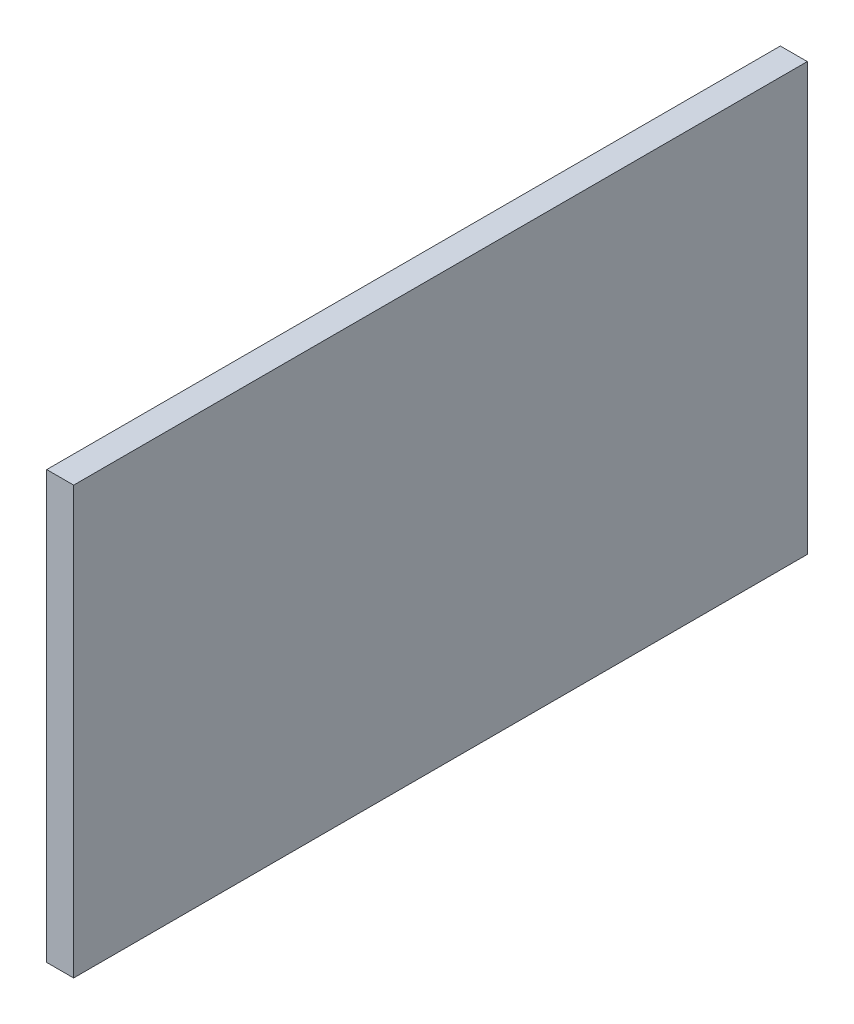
ISO-10303-21;
HEADER;
FILE_DESCRIPTION(('STEP AP214'),'2;1');
FILE_NAME('part.step','',(''),(''),'','','');
FILE_SCHEMA(('AUTOMOTIVE_DESIGN { 1 0 10303 214 1 1 1 1 }'));
ENDSEC;
DATA;
#1=APPLICATION_CONTEXT('core data for automotive mechanical design processes');
#2=APPLICATION_PROTOCOL_DEFINITION('international standard','automotive_design',2000,#1);
#3=PRODUCT_CONTEXT('',#1,'mechanical');
#4=PRODUCT('Part','Part','',(#3));
#5=PRODUCT_RELATED_PRODUCT_CATEGORY('part','',(#4));
#6=PRODUCT_DEFINITION_FORMATION('','',#4);
#7=PRODUCT_DEFINITION_CONTEXT('part definition',#1,'design');
#8=PRODUCT_DEFINITION('design','',#6,#7);
#9=PRODUCT_DEFINITION_SHAPE('','',#8);
#10=(LENGTH_UNIT() NAMED_UNIT(*) SI_UNIT(.MILLI.,.METRE.));
#11=(NAMED_UNIT(*) PLANE_ANGLE_UNIT() SI_UNIT($,.RADIAN.));
#12=(NAMED_UNIT(*) SI_UNIT($,.STERADIAN.) SOLID_ANGLE_UNIT());
#13=UNCERTAINTY_MEASURE_WITH_UNIT(LENGTH_MEASURE(1.E-05),#10,'distance_accuracy_value','');
#14=(GEOMETRIC_REPRESENTATION_CONTEXT(3) GLOBAL_UNCERTAINTY_ASSIGNED_CONTEXT((#13)) GLOBAL_UNIT_ASSIGNED_CONTEXT((#10,
#11,#12)) REPRESENTATION_CONTEXT('',''));
#15=CARTESIAN_POINT('',(0.,0.,0.));
#16=DIRECTION('',(0.,0.,1.));
#17=DIRECTION('',(1.,0.,0.));
#18=AXIS2_PLACEMENT_3D('',#15,#16,#17);
#19=CARTESIAN_POINT('',(263.000000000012,932.602516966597,-490.));
#20=DIRECTION('',(-1.,0.,0.));
#21=DIRECTION('',(0.,-1.,0.));
#22=AXIS2_PLACEMENT_3D('',#19,#20,#21);
#23=PLANE('',#22);
#24=DIRECTION('',(0.,-1.,0.));
#25=VECTOR('',#24,1.);
#26=CARTESIAN_POINT('',(263.000000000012,932.602516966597,0.));
#27=LINE('',#26,#25);
#28=CARTESIAN_POINT('',(263.000000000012,932.602516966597,0.));
#29=VERTEX_POINT('',#28);
#30=CARTESIAN_POINT('',(263.000000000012,647.500000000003,0.));
#31=VERTEX_POINT('',#30);
#32=EDGE_CURVE('E97',#29,#31,#27,.T.);
#33=ORIENTED_EDGE('',*,*,#32,.F.);
#34=DIRECTION('',(0.,0.,1.));
#35=VECTOR('',#34,1.);
#36=CARTESIAN_POINT('',(263.000000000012,932.602516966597,-490.));
#37=LINE('',#36,#35);
#38=CARTESIAN_POINT('',(263.000000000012,932.602516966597,-490.));
#39=VERTEX_POINT('',#38);
#40=EDGE_CURVE('E11',#39,#29,#37,.T.);
#41=ORIENTED_EDGE('',*,*,#40,.F.);
#42=DIRECTION('',(0.,-1.,0.));
#43=VECTOR('',#42,1.);
#44=CARTESIAN_POINT('',(263.000000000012,932.602516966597,-490.));
#45=LINE('',#44,#43);
#46=CARTESIAN_POINT('',(263.000000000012,647.500000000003,-490.));
#47=VERTEX_POINT('',#46);
#48=EDGE_CURVE('E91',#39,#47,#45,.T.);
#49=ORIENTED_EDGE('',*,*,#48,.T.);
#50=DIRECTION('',(0.,0.,1.));
#51=VECTOR('',#50,1.);
#52=CARTESIAN_POINT('',(263.000000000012,647.500000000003,-490.));
#53=LINE('',#52,#51);
#54=EDGE_CURVE('E36',#47,#31,#53,.T.);
#55=ORIENTED_EDGE('',*,*,#54,.T.);
#56=EDGE_LOOP('',(#33,#41,#49,#55));
#57=FACE_BOUND('',#56,.T.);
#58=ADVANCED_FACE('F33',(#57),#23,.T.);
#59=CARTESIAN_POINT('',(263.000000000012,932.602516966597,-490.));
#60=DIRECTION('',(0.,1.,0.));
#61=DIRECTION('',(0.,0.,1.));
#62=AXIS2_PLACEMENT_3D('',#59,#60,#61);
#63=PLANE('',#62);
#64=DIRECTION('',(-1.,0.,0.));
#65=VECTOR('',#64,1.);
#66=CARTESIAN_POINT('',(263.000000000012,932.602516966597,0.));
#67=LINE('',#66,#65);
#68=CARTESIAN_POINT('',(281.000000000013,932.602516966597,0.));
#69=VERTEX_POINT('',#68);
#70=EDGE_CURVE('E93',#69,#29,#67,.T.);
#71=ORIENTED_EDGE('',*,*,#70,.F.);
#72=DIRECTION('',(0.,0.,1.));
#73=VECTOR('',#72,1.);
#74=CARTESIAN_POINT('',(281.000000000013,932.602516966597,-490.));
#75=LINE('',#74,#73);
#76=CARTESIAN_POINT('',(281.000000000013,932.602516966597,-490.));
#77=VERTEX_POINT('',#76);
#78=EDGE_CURVE('E42',#77,#69,#75,.T.);
#79=ORIENTED_EDGE('',*,*,#78,.F.);
#80=DIRECTION('',(-1.,0.,0.));
#81=VECTOR('',#80,1.);
#82=CARTESIAN_POINT('',(263.000000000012,932.602516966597,-490.));
#83=LINE('',#82,#81);
#84=EDGE_CURVE('E88',#77,#39,#83,.T.);
#85=ORIENTED_EDGE('',*,*,#84,.T.);
#86=ORIENTED_EDGE('',*,*,#40,.T.);
#87=EDGE_LOOP('',(#71,#79,#85,#86));
#88=FACE_BOUND('',#87,.T.);
#89=ADVANCED_FACE('F107',(#88),#63,.T.);
#90=CARTESIAN_POINT('',(281.000000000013,932.602516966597,-490.));
#91=DIRECTION('',(0.999999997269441,-7.38993805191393E-05,0.));
#92=DIRECTION('',(7.38993805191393E-05,0.999999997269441,0.));
#93=AXIS2_PLACEMENT_3D('',#90,#91,#92);
#94=PLANE('',#93);
#95=DIRECTION('',(7.38993805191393E-05,0.999999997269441,0.));
#96=VECTOR('',#95,1.);
#97=CARTESIAN_POINT('',(281.000000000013,932.602516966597,0.));
#98=LINE('',#97,#96);
#99=CARTESIAN_POINT('',(280.978931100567,647.500000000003,0.));
#100=VERTEX_POINT('',#99);
#101=EDGE_CURVE('E83',#100,#69,#98,.T.);
#102=ORIENTED_EDGE('',*,*,#101,.F.);
#103=DIRECTION('',(0.,0.,1.));
#104=VECTOR('',#103,1.);
#105=CARTESIAN_POINT('',(280.978931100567,647.500000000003,-490.));
#106=LINE('',#105,#104);
#107=CARTESIAN_POINT('',(280.978931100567,647.500000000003,-490.));
#108=VERTEX_POINT('',#107);
#109=EDGE_CURVE('E78',#108,#100,#106,.T.);
#110=ORIENTED_EDGE('',*,*,#109,.F.);
#111=DIRECTION('',(7.38993805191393E-05,0.999999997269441,0.));
#112=VECTOR('',#111,1.);
#113=CARTESIAN_POINT('',(281.000000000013,932.602516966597,-490.));
#114=LINE('',#113,#112);
#115=EDGE_CURVE('E81',#108,#77,#114,.T.);
#116=ORIENTED_EDGE('',*,*,#115,.T.);
#117=ORIENTED_EDGE('',*,*,#78,.T.);
#118=EDGE_LOOP('',(#102,#110,#116,#117));
#119=FACE_BOUND('',#118,.T.);
#120=ADVANCED_FACE('F80',(#119),#94,.T.);
#121=CARTESIAN_POINT('',(263.000000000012,647.500000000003,-490.));
#122=DIRECTION('',(0.,-1.,0.));
#123=DIRECTION('',(0.,0.,-1.));
#124=AXIS2_PLACEMENT_3D('',#121,#122,#123);
#125=PLANE('',#124);
#126=DIRECTION('',(1.,0.,0.));
#127=VECTOR('',#126,1.);
#128=CARTESIAN_POINT('',(263.000000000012,647.500000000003,0.));
#129=LINE('',#128,#127);
#130=EDGE_CURVE('E100',#31,#100,#129,.T.);
#131=ORIENTED_EDGE('',*,*,#130,.F.);
#132=ORIENTED_EDGE('',*,*,#54,.F.);
#133=DIRECTION('',(1.,0.,0.));
#134=VECTOR('',#133,1.);
#135=CARTESIAN_POINT('',(263.000000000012,647.500000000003,-490.));
#136=LINE('',#135,#134);
#137=EDGE_CURVE('E87',#47,#108,#136,.T.);
#138=ORIENTED_EDGE('',*,*,#137,.T.);
#139=ORIENTED_EDGE('',*,*,#109,.T.);
#140=EDGE_LOOP('',(#131,#132,#138,#139));
#141=FACE_BOUND('',#140,.T.);
#142=ADVANCED_FACE('F90',(#141),#125,.T.);
#143=CARTESIAN_POINT('',(0.,0.,-490.));
#144=DIRECTION('',(0.,0.,1.));
#145=DIRECTION('',(1.,0.,0.));
#146=AXIS2_PLACEMENT_3D('',#143,#144,#145);
#147=PLANE('',#146);
#148=ORIENTED_EDGE('',*,*,#48,.F.);
#149=ORIENTED_EDGE('',*,*,#84,.F.);
#150=ORIENTED_EDGE('',*,*,#115,.F.);
#151=ORIENTED_EDGE('',*,*,#137,.F.);
#152=EDGE_LOOP('',(#148,#149,#150,#151));
#153=FACE_BOUND('',#152,.T.);
#154=ADVANCED_FACE('F86',(#153),#147,.F.);
#155=CARTESIAN_POINT('',(0.,0.,0.));
#156=DIRECTION('',(0.,0.,1.));
#157=DIRECTION('',(1.,0.,0.));
#158=AXIS2_PLACEMENT_3D('',#155,#156,#157);
#159=PLANE('',#158);
#160=ORIENTED_EDGE('',*,*,#32,.T.);
#161=ORIENTED_EDGE('',*,*,#130,.T.);
#162=ORIENTED_EDGE('',*,*,#101,.T.);
#163=ORIENTED_EDGE('',*,*,#70,.T.);
#164=EDGE_LOOP('',(#160,#161,#162,#163));
#165=FACE_BOUND('',#164,.T.);
#166=ADVANCED_FACE('F106',(#165),#159,.T.);
#167=CLOSED_SHELL('',(#58,#89,#120,#142,#154,#166));
#168=MANIFOLD_SOLID_BREP('B2',#167);
#169=ADVANCED_BREP_SHAPE_REPRESENTATION('',(#18,#168),#14);
#170=SHAPE_DEFINITION_REPRESENTATION(#9,#169);
ENDSEC;
END-ISO-10303-21;
